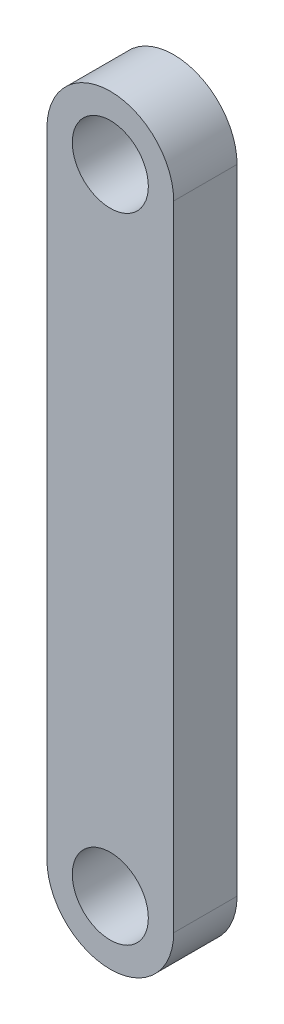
from build123d import *

# Parameters (mm, degrees)
SKETCH1_R      = 3
EXTRUDE1_DEPTH = 2.5


with BuildPart() as part:
    # Sketch1 → Extrude1 (new, symmetric)
    with BuildSketch(Plane.XY):
        with BuildLine():
            Line((5, 0), (5, 50))
            ThreePointArc((5, 50), (0, 55), (-5, 50))
            Line((-5, 50), (-5, 0))
            ThreePointArc((-5, 0), (0, -5), (5, 0))
        make_face()
        with Locations((0, 50)):
            Circle(SKETCH1_R, mode=Mode.SUBTRACT)
        Circle(SKETCH1_R, mode=Mode.SUBTRACT)
    extrude(amount=EXTRUDE1_DEPTH, both=True)


solid = part.part
